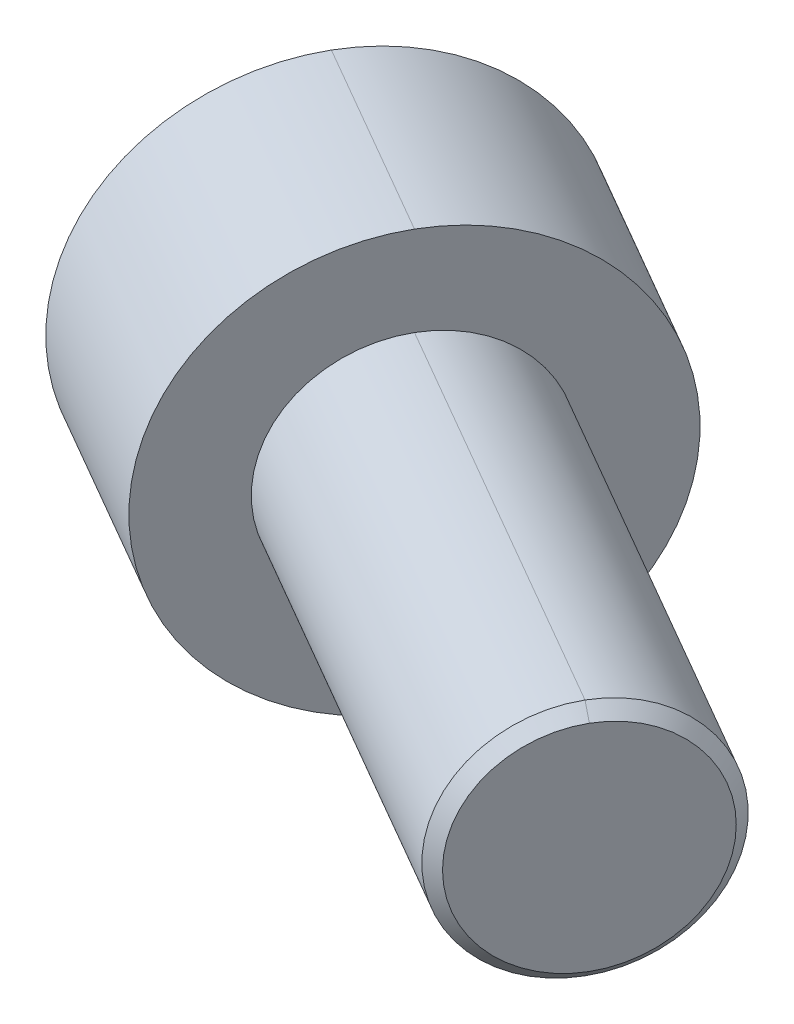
ISO-10303-21;
HEADER;
FILE_DESCRIPTION(('STEP AP214'),'2;1');
FILE_NAME('part.step','',(''),(''),'','','');
FILE_SCHEMA(('AUTOMOTIVE_DESIGN { 1 0 10303 214 1 1 1 1 }'));
ENDSEC;
DATA;
#1=APPLICATION_CONTEXT('core data for automotive mechanical design processes');
#2=APPLICATION_PROTOCOL_DEFINITION('international standard','automotive_design',2000,#1);
#3=PRODUCT_CONTEXT('',#1,'mechanical');
#4=PRODUCT('Part','Part','',(#3));
#5=PRODUCT_RELATED_PRODUCT_CATEGORY('part','',(#4));
#6=PRODUCT_DEFINITION_FORMATION('','',#4);
#7=PRODUCT_DEFINITION_CONTEXT('part definition',#1,'design');
#8=PRODUCT_DEFINITION('design','',#6,#7);
#9=PRODUCT_DEFINITION_SHAPE('','',#8);
#10=(LENGTH_UNIT() NAMED_UNIT(*) SI_UNIT(.MILLI.,.METRE.));
#11=(NAMED_UNIT(*) PLANE_ANGLE_UNIT() SI_UNIT($,.RADIAN.));
#12=(NAMED_UNIT(*) SI_UNIT($,.STERADIAN.) SOLID_ANGLE_UNIT());
#13=UNCERTAINTY_MEASURE_WITH_UNIT(LENGTH_MEASURE(1.E-05),#10,'distance_accuracy_value','');
#14=(GEOMETRIC_REPRESENTATION_CONTEXT(3) GLOBAL_UNCERTAINTY_ASSIGNED_CONTEXT((#13)) GLOBAL_UNIT_ASSIGNED_CONTEXT((#10,
#11,#12)) REPRESENTATION_CONTEXT('',''));
#15=CARTESIAN_POINT('',(0.,0.,0.));
#16=DIRECTION('',(0.,0.,1.));
#17=DIRECTION('',(1.,0.,0.));
#18=AXIS2_PLACEMENT_3D('',#15,#16,#17);
#19=CARTESIAN_POINT('',(-45.72614131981,-60.262,-26.4));
#20=DIRECTION('',(-0.866025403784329,0.,-0.50000000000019));
#21=DIRECTION('',(-0.50000000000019,0.,0.866025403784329));
#22=AXIS2_PLACEMENT_3D('',#19,#20,#21);
#23=PLANE('',#22);
#24=DIRECTION('',(-0.250000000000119,0.866025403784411,0.433012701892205));
#25=VECTOR('',#24,1.);
#26=CARTESIAN_POINT('',(-45.29312861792,-58.762,-27.15));
#27=LINE('',#26,#25);
#28=CARTESIAN_POINT('',(-44.86011591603,-60.262,-27.9));
#29=VERTEX_POINT('',#28);
#30=CARTESIAN_POINT('',(-45.29312861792,-58.762,-27.15));
#31=VERTEX_POINT('',#30);
#32=EDGE_CURVE('E142',#29,#31,#27,.T.);
#33=ORIENTED_EDGE('',*,*,#32,.F.);
#34=DIRECTION('',(0.250000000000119,0.866025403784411,-0.433012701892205));
#35=VECTOR('',#34,1.);
#36=CARTESIAN_POINT('',(-44.86011591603,-60.262,-27.9));
#37=LINE('',#36,#35);
#38=CARTESIAN_POINT('',(-45.29312861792,-61.762,-27.15));
#39=VERTEX_POINT('',#38);
#40=EDGE_CURVE('E10',#39,#29,#37,.T.);
#41=ORIENTED_EDGE('',*,*,#40,.F.);
#42=DIRECTION('',(0.50000000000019,0.,-0.866025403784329));
#43=VECTOR('',#42,1.);
#44=CARTESIAN_POINT('',(-45.29312861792,-61.762,-27.15));
#45=LINE('',#44,#43);
#46=CARTESIAN_POINT('',(-46.15915402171,-61.762,-25.65));
#47=VERTEX_POINT('',#46);
#48=EDGE_CURVE('E201',#47,#39,#45,.T.);
#49=ORIENTED_EDGE('',*,*,#48,.F.);
#50=DIRECTION('',(0.250000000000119,-0.866025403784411,-0.433012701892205));
#51=VECTOR('',#50,1.);
#52=CARTESIAN_POINT('',(-46.15915402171,-61.762,-25.65));
#53=LINE('',#52,#51);
#54=CARTESIAN_POINT('',(-46.5921667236,-60.262,-24.9));
#55=VERTEX_POINT('',#54);
#56=EDGE_CURVE('E298',#55,#47,#53,.T.);
#57=ORIENTED_EDGE('',*,*,#56,.F.);
#58=DIRECTION('',(-0.250000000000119,-0.866025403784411,0.433012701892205));
#59=VECTOR('',#58,1.);
#60=CARTESIAN_POINT('',(-46.5921667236,-60.262,-24.9));
#61=LINE('',#60,#59);
#62=CARTESIAN_POINT('',(-46.15915402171,-58.762,-25.65));
#63=VERTEX_POINT('',#62);
#64=EDGE_CURVE('E147',#63,#55,#61,.T.);
#65=ORIENTED_EDGE('',*,*,#64,.F.);
#66=DIRECTION('',(-0.50000000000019,0.,0.866025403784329));
#67=VECTOR('',#66,1.);
#68=CARTESIAN_POINT('',(-46.15915402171,-58.762,-25.65));
#69=LINE('',#68,#67);
#70=EDGE_CURVE('E206',#31,#63,#69,.T.);
#71=ORIENTED_EDGE('',*,*,#70,.F.);
#72=EDGE_LOOP('',(#33,#41,#49,#57,#65,#71));
#73=FACE_BOUND('',#72,.T.);
#74=ADVANCED_FACE('F16',(#73),#23,.T.);
#75=CARTESIAN_POINT('',(-44.86011591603,-60.262,-27.9));
#76=DIRECTION('',(-0.433012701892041,0.500000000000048,0.750000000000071));
#77=DIRECTION('',(0.755928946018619,0.654653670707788,0.));
#78=AXIS2_PLACEMENT_3D('',#75,#76,#77);
#79=PLANE('',#78);
#80=DIRECTION('',(0.250000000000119,0.866025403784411,-0.433012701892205));
#81=VECTOR('',#80,1.);
#82=CARTESIAN_POINT('',(-46.5921667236,-60.262,-28.9));
#83=LINE('',#82,#81);
#84=CARTESIAN_POINT('',(-47.02517942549,-61.762,-28.15));
#85=VERTEX_POINT('',#84);
#86=CARTESIAN_POINT('',(-46.5921667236,-60.262,-28.9));
#87=VERTEX_POINT('',#86);
#88=EDGE_CURVE('E184',#85,#87,#83,.T.);
#89=ORIENTED_EDGE('',*,*,#88,.F.);
#90=DIRECTION('',(-0.866025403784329,0.,-0.50000000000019));
#91=VECTOR('',#90,1.);
#92=CARTESIAN_POINT('',(-45.29312861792,-61.762,-27.15));
#93=LINE('',#92,#91);
#94=EDGE_CURVE('E27',#39,#85,#93,.T.);
#95=ORIENTED_EDGE('',*,*,#94,.F.);
#96=ORIENTED_EDGE('',*,*,#40,.T.);
#97=DIRECTION('',(-0.866025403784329,0.,-0.50000000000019));
#98=VECTOR('',#97,1.);
#99=CARTESIAN_POINT('',(-44.86011591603,-60.262,-27.9));
#100=LINE('',#99,#98);
#101=EDGE_CURVE('E146',#29,#87,#100,.T.);
#102=ORIENTED_EDGE('',*,*,#101,.T.);
#103=EDGE_LOOP('',(#89,#95,#96,#102));
#104=FACE_BOUND('',#103,.T.);
#105=ADVANCED_FACE('F261',(#104),#79,.T.);
#106=CARTESIAN_POINT('',(-45.29312861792,-61.762,-27.15));
#107=DIRECTION('',(0.,1.,0.));
#108=DIRECTION('',(0.,0.,-1.));
#109=AXIS2_PLACEMENT_3D('',#106,#107,#108);
#110=PLANE('',#109);
#111=DIRECTION('',(0.50000000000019,0.,-0.866025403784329));
#112=VECTOR('',#111,1.);
#113=CARTESIAN_POINT('',(-47.02517942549,-61.762,-28.15));
#114=LINE('',#113,#112);
#115=CARTESIAN_POINT('',(-47.89120482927,-61.762,-26.65));
#116=VERTEX_POINT('',#115);
#117=EDGE_CURVE('E156',#116,#85,#114,.T.);
#118=ORIENTED_EDGE('',*,*,#117,.F.);
#119=DIRECTION('',(-0.866025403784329,0.,-0.50000000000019));
#120=VECTOR('',#119,1.);
#121=CARTESIAN_POINT('',(-46.15915402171,-61.762,-25.65));
#122=LINE('',#121,#120);
#123=EDGE_CURVE('E224',#47,#116,#122,.T.);
#124=ORIENTED_EDGE('',*,*,#123,.F.);
#125=ORIENTED_EDGE('',*,*,#48,.T.);
#126=ORIENTED_EDGE('',*,*,#94,.T.);
#127=EDGE_LOOP('',(#118,#124,#125,#126));
#128=FACE_BOUND('',#127,.T.);
#129=ADVANCED_FACE('F266',(#128),#110,.T.);
#130=CARTESIAN_POINT('',(-46.15915402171,-61.762,-25.65));
#131=DIRECTION('',(0.433012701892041,0.500000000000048,-0.750000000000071));
#132=DIRECTION('',(-0.866025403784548,0.,-0.49999999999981));
#133=AXIS2_PLACEMENT_3D('',#130,#131,#132);
#134=PLANE('',#133);
#135=DIRECTION('',(0.250000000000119,-0.866025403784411,-0.433012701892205));
#136=VECTOR('',#135,1.);
#137=CARTESIAN_POINT('',(-47.89120482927,-61.762,-26.65));
#138=LINE('',#137,#136);
#139=CARTESIAN_POINT('',(-48.32421753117,-60.262,-25.9));
#140=VERTEX_POINT('',#139);
#141=EDGE_CURVE('E159',#140,#116,#138,.T.);
#142=ORIENTED_EDGE('',*,*,#141,.F.);
#143=DIRECTION('',(-0.866025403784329,0.,-0.50000000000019));
#144=VECTOR('',#143,1.);
#145=CARTESIAN_POINT('',(-46.5921667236,-60.262,-24.9));
#146=LINE('',#145,#144);
#147=EDGE_CURVE('E151',#55,#140,#146,.T.);
#148=ORIENTED_EDGE('',*,*,#147,.F.);
#149=ORIENTED_EDGE('',*,*,#56,.T.);
#150=ORIENTED_EDGE('',*,*,#123,.T.);
#151=EDGE_LOOP('',(#142,#148,#149,#150));
#152=FACE_BOUND('',#151,.T.);
#153=ADVANCED_FACE('F18',(#152),#134,.T.);
#154=CARTESIAN_POINT('',(-46.5921667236,-60.262,-24.9));
#155=DIRECTION('',(0.433012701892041,-0.500000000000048,-0.750000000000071));
#156=DIRECTION('',(0.,-0.832050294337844,0.554700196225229));
#157=AXIS2_PLACEMENT_3D('',#154,#155,#156);
#158=PLANE('',#157);
#159=DIRECTION('',(-0.250000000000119,-0.866025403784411,0.433012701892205));
#160=VECTOR('',#159,1.);
#161=CARTESIAN_POINT('',(-48.32421753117,-60.262,-25.9));
#162=LINE('',#161,#160);
#163=CARTESIAN_POINT('',(-47.89120482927,-58.762,-26.65));
#164=VERTEX_POINT('',#163);
#165=EDGE_CURVE('E173',#164,#140,#162,.T.);
#166=ORIENTED_EDGE('',*,*,#165,.F.);
#167=DIRECTION('',(-0.866025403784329,0.,-0.50000000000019));
#168=VECTOR('',#167,1.);
#169=CARTESIAN_POINT('',(-46.15915402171,-58.762,-25.65));
#170=LINE('',#169,#168);
#171=EDGE_CURVE('E20',#63,#164,#170,.T.);
#172=ORIENTED_EDGE('',*,*,#171,.F.);
#173=ORIENTED_EDGE('',*,*,#64,.T.);
#174=ORIENTED_EDGE('',*,*,#147,.T.);
#175=EDGE_LOOP('',(#166,#172,#173,#174));
#176=FACE_BOUND('',#175,.T.);
#177=ADVANCED_FACE('F346',(#176),#158,.T.);
#178=CARTESIAN_POINT('',(-46.15915402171,-58.762,-25.65));
#179=DIRECTION('',(0.,-1.,0.));
#180=DIRECTION('',(0.,0.,-1.));
#181=AXIS2_PLACEMENT_3D('',#178,#179,#180);
#182=PLANE('',#181);
#183=DIRECTION('',(-0.50000000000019,0.,0.866025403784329));
#184=VECTOR('',#183,1.);
#185=CARTESIAN_POINT('',(-47.89120482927,-58.762,-26.65));
#186=LINE('',#185,#184);
#187=CARTESIAN_POINT('',(-47.02517942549,-58.762,-28.15));
#188=VERTEX_POINT('',#187);
#189=EDGE_CURVE('E170',#188,#164,#186,.T.);
#190=ORIENTED_EDGE('',*,*,#189,.F.);
#191=DIRECTION('',(-0.866025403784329,0.,-0.50000000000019));
#192=VECTOR('',#191,1.);
#193=CARTESIAN_POINT('',(-45.29312861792,-58.762,-27.15));
#194=LINE('',#193,#192);
#195=EDGE_CURVE('E145',#31,#188,#194,.T.);
#196=ORIENTED_EDGE('',*,*,#195,.F.);
#197=ORIENTED_EDGE('',*,*,#70,.T.);
#198=ORIENTED_EDGE('',*,*,#171,.T.);
#199=EDGE_LOOP('',(#190,#196,#197,#198));
#200=FACE_BOUND('',#199,.T.);
#201=ADVANCED_FACE('F255',(#200),#182,.T.);
#202=CARTESIAN_POINT('',(-45.29312861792,-58.762,-27.15));
#203=DIRECTION('',(-0.433012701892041,-0.500000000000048,0.750000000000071));
#204=DIRECTION('',(-0.755928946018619,0.654653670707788,0.));
#205=AXIS2_PLACEMENT_3D('',#202,#203,#204);
#206=PLANE('',#205);
#207=DIRECTION('',(-0.250000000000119,0.866025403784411,0.433012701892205));
#208=VECTOR('',#207,1.);
#209=CARTESIAN_POINT('',(-47.02517942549,-58.762,-28.15));
#210=LINE('',#209,#208);
#211=EDGE_CURVE('E174',#87,#188,#210,.T.);
#212=ORIENTED_EDGE('',*,*,#211,.F.);
#213=ORIENTED_EDGE('',*,*,#101,.F.);
#214=ORIENTED_EDGE('',*,*,#32,.T.);
#215=ORIENTED_EDGE('',*,*,#195,.T.);
#216=EDGE_LOOP('',(#212,#213,#214,#215));
#217=FACE_BOUND('',#216,.T.);
#218=ADVANCED_FACE('F246',(#217),#206,.T.);
#219=CARTESIAN_POINT('',(-36.16588728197,-60.262,-22.95884572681));
#220=DIRECTION('',(0.866025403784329,0.,0.50000000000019));
#221=DIRECTION('',(0.,-1.,0.));
#222=AXIS2_PLACEMENT_3D('',#219,#220,#221);
#223=PLANE('',#222);
#224=CARTESIAN_POINT('',(-37.06588728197,-60.262,-21.4));
#225=DIRECTION('',(-0.866025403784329,0.,-0.50000000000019));
#226=DIRECTION('',(0.,1.,0.));
#227=AXIS2_PLACEMENT_3D('',#224,#225,#226);
#228=CIRCLE('',#227,1.8);
#229=CARTESIAN_POINT('',(-37.06588728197,-58.462,-21.4));
#230=VERTEX_POINT('',#229);
#231=CARTESIAN_POINT('',(-37.06588728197,-62.062,-21.4));
#232=VERTEX_POINT('',#231);
#233=EDGE_CURVE('E161',#230,#232,#228,.T.);
#234=ORIENTED_EDGE('',*,*,#233,.F.);
#235=CARTESIAN_POINT('',(-37.06588728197,-60.262,-21.4));
#236=DIRECTION('',(-0.866025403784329,0.,-0.50000000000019));
#237=DIRECTION('',(0.,1.,0.));
#238=AXIS2_PLACEMENT_3D('',#235,#236,#237);
#239=CIRCLE('',#238,1.8);
#240=EDGE_CURVE('E155',#232,#230,#239,.T.);
#241=ORIENTED_EDGE('',*,*,#240,.F.);
#242=EDGE_LOOP('',(#234,#241));
#243=FACE_BOUND('',#242,.T.);
#244=ADVANCED_FACE('F244',(#243),#223,.T.);
#245=CARTESIAN_POINT('',(-37.23909236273,-60.262,-21.5));
#246=DIRECTION('',(-0.866025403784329,0.,-0.50000000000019));
#247=DIRECTION('',(0.,1.,0.));
#248=AXIS2_PLACEMENT_3D('',#245,#246,#247);
#249=CONICAL_SURFACE('',#248,2.,0.785398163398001);
#250=DIRECTION('',(-0.612372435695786,-0.707106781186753,-0.353553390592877));
#251=VECTOR('',#250,1.);
#252=CARTESIAN_POINT('',(-37.23909236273,-62.262,-21.5));
#253=LINE('',#252,#251);
#254=CARTESIAN_POINT('',(-37.23909236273,-62.262,-21.5));
#255=VERTEX_POINT('',#254);
#256=EDGE_CURVE('E165',#232,#255,#253,.T.);
#257=ORIENTED_EDGE('',*,*,#256,.F.);
#258=ORIENTED_EDGE('',*,*,#240,.T.);
#259=DIRECTION('',(-0.612372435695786,0.707106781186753,-0.353553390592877));
#260=VECTOR('',#259,1.);
#261=CARTESIAN_POINT('',(-37.23909236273,-58.262,-21.5));
#262=LINE('',#261,#260);
#263=CARTESIAN_POINT('',(-37.23909236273,-58.262,-21.5));
#264=VERTEX_POINT('',#263);
#265=EDGE_CURVE('E140',#230,#264,#262,.T.);
#266=ORIENTED_EDGE('',*,*,#265,.T.);
#267=CARTESIAN_POINT('',(-37.23909236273,-60.262,-21.5));
#268=DIRECTION('',(-0.866025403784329,0.,-0.50000000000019));
#269=DIRECTION('',(0.,1.,0.));
#270=AXIS2_PLACEMENT_3D('',#267,#268,#269);
#271=CIRCLE('',#270,2.);
#272=EDGE_CURVE('E210',#255,#264,#271,.T.);
#273=ORIENTED_EDGE('',*,*,#272,.F.);
#274=EDGE_LOOP('',(#257,#258,#266,#273));
#275=FACE_BOUND('',#274,.T.);
#276=ADVANCED_FACE('F237',(#275),#249,.T.);
#277=CARTESIAN_POINT('',(-477.0067924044,-60.262,-275.4));
#278=DIRECTION('',(-0.866025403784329,0.,-0.50000000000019));
#279=DIRECTION('',(0.,1.,0.));
#280=AXIS2_PLACEMENT_3D('',#277,#278,#279);
#281=CYLINDRICAL_SURFACE('',#280,2.);
#282=DIRECTION('',(-0.866025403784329,0.,-0.50000000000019));
#283=VECTOR('',#282,1.);
#284=CARTESIAN_POINT('',(-477.0067924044,-62.262,-275.4));
#285=LINE('',#284,#283);
#286=CARTESIAN_POINT('',(-43.99409051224,-62.262,-25.4));
#287=VERTEX_POINT('',#286);
#288=EDGE_CURVE('E225',#255,#287,#285,.T.);
#289=ORIENTED_EDGE('',*,*,#288,.F.);
#290=ORIENTED_EDGE('',*,*,#272,.T.);
#291=DIRECTION('',(-0.866025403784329,0.,-0.50000000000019));
#292=VECTOR('',#291,1.);
#293=CARTESIAN_POINT('',(-477.0067924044,-58.262,-275.4));
#294=LINE('',#293,#292);
#295=CARTESIAN_POINT('',(-43.99409051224,-58.262,-25.4));
#296=VERTEX_POINT('',#295);
#297=EDGE_CURVE('E127',#264,#296,#294,.T.);
#298=ORIENTED_EDGE('',*,*,#297,.T.);
#299=CARTESIAN_POINT('',(-43.99409051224,-60.262,-25.4));
#300=DIRECTION('',(-0.866025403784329,0.,-0.50000000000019));
#301=DIRECTION('',(0.,1.,0.));
#302=AXIS2_PLACEMENT_3D('',#299,#300,#301);
#303=CIRCLE('',#302,2.);
#304=EDGE_CURVE('E113',#287,#296,#303,.T.);
#305=ORIENTED_EDGE('',*,*,#304,.F.);
#306=EDGE_LOOP('',(#289,#290,#298,#305));
#307=FACE_BOUND('',#306,.T.);
#308=ADVANCED_FACE('F253',(#307),#281,.T.);
#309=CARTESIAN_POINT('',(-42.24409051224,-60.262,-28.43108891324));
#310=DIRECTION('',(0.866025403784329,0.,0.50000000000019));
#311=DIRECTION('',(0.,-1.,0.));
#312=AXIS2_PLACEMENT_3D('',#309,#310,#311);
#313=PLANE('',#312);
#314=CARTESIAN_POINT('',(-43.99409051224,-60.262,-25.4));
#315=DIRECTION('',(-0.866025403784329,0.,-0.50000000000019));
#316=DIRECTION('',(0.,1.,0.));
#317=AXIS2_PLACEMENT_3D('',#314,#315,#316);
#318=CIRCLE('',#317,3.5);
#319=CARTESIAN_POINT('',(-43.99409051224,-56.762,-25.4));
#320=VERTEX_POINT('',#319);
#321=CARTESIAN_POINT('',(-43.99409051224,-63.762,-25.4));
#322=VERTEX_POINT('',#321);
#323=EDGE_CURVE('E118',#320,#322,#318,.T.);
#324=ORIENTED_EDGE('',*,*,#323,.F.);
#325=CARTESIAN_POINT('',(-43.99409051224,-60.262,-25.4));
#326=DIRECTION('',(-0.866025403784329,0.,-0.50000000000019));
#327=DIRECTION('',(0.,1.,0.));
#328=AXIS2_PLACEMENT_3D('',#325,#326,#327);
#329=CIRCLE('',#328,3.5);
#330=EDGE_CURVE('E101',#322,#320,#329,.T.);
#331=ORIENTED_EDGE('',*,*,#330,.F.);
#332=EDGE_LOOP('',(#324,#331));
#333=FACE_BOUND('',#332,.T.);
#334=CARTESIAN_POINT('',(-43.99409051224,-60.262,-25.4));
#335=DIRECTION('',(-0.866025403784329,0.,-0.50000000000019));
#336=DIRECTION('',(0.,1.,0.));
#337=AXIS2_PLACEMENT_3D('',#334,#335,#336);
#338=CIRCLE('',#337,2.);
#339=EDGE_CURVE('E136',#296,#287,#338,.T.);
#340=ORIENTED_EDGE('',*,*,#339,.T.);
#341=ORIENTED_EDGE('',*,*,#304,.T.);
#342=EDGE_LOOP('',(#340,#341));
#343=FACE_BOUND('',#342,.T.);
#344=ADVANCED_FACE('F124',(#333,#343),#313,.T.);
#345=CARTESIAN_POINT('',(-477.0067924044,-60.262,-275.4));
#346=DIRECTION('',(-0.866025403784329,0.,-0.50000000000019));
#347=DIRECTION('',(0.,1.,0.));
#348=AXIS2_PLACEMENT_3D('',#345,#346,#347);
#349=CYLINDRICAL_SURFACE('',#348,3.5);
#350=DIRECTION('',(-0.866025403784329,0.,-0.50000000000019));
#351=VECTOR('',#350,1.);
#352=CARTESIAN_POINT('',(-477.0067924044,-63.762,-275.4));
#353=LINE('',#352,#351);
#354=CARTESIAN_POINT('',(-47.28498704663,-63.762,-27.3));
#355=VERTEX_POINT('',#354);
#356=EDGE_CURVE('E108',#322,#355,#353,.T.);
#357=ORIENTED_EDGE('',*,*,#356,.F.);
#358=ORIENTED_EDGE('',*,*,#330,.T.);
#359=DIRECTION('',(-0.866025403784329,0.,-0.50000000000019));
#360=VECTOR('',#359,1.);
#361=CARTESIAN_POINT('',(-477.0067924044,-56.762,-275.4));
#362=LINE('',#361,#360);
#363=CARTESIAN_POINT('',(-47.28498704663,-56.762,-27.3));
#364=VERTEX_POINT('',#363);
#365=EDGE_CURVE('E105',#320,#364,#362,.T.);
#366=ORIENTED_EDGE('',*,*,#365,.T.);
#367=CARTESIAN_POINT('',(-47.28498704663,-60.262,-27.3));
#368=DIRECTION('',(-0.866025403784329,0.,-0.50000000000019));
#369=DIRECTION('',(0.,1.,0.));
#370=AXIS2_PLACEMENT_3D('',#367,#368,#369);
#371=CIRCLE('',#370,3.5);
#372=EDGE_CURVE('E114',#355,#364,#371,.T.);
#373=ORIENTED_EDGE('',*,*,#372,.F.);
#374=EDGE_LOOP('',(#357,#358,#366,#373));
#375=FACE_BOUND('',#374,.T.);
#376=ADVANCED_FACE('F103',(#375),#349,.T.);
#377=CARTESIAN_POINT('',(-47.45819212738,-60.262,-27.4));
#378=DIRECTION('',(0.866025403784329,0.,0.50000000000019));
#379=DIRECTION('',(0.,-1.,0.));
#380=AXIS2_PLACEMENT_3D('',#377,#378,#379);
#381=CONICAL_SURFACE('',#380,3.3,0.785398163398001);
#382=DIRECTION('',(0.612372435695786,0.707106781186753,0.353553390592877));
#383=VECTOR('',#382,1.);
#384=CARTESIAN_POINT('',(-47.45819212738,-56.962,-27.4));
#385=LINE('',#384,#383);
#386=CARTESIAN_POINT('',(-47.45819212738,-56.962,-27.4));
#387=VERTEX_POINT('',#386);
#388=EDGE_CURVE('E166',#387,#364,#385,.T.);
#389=ORIENTED_EDGE('',*,*,#388,.F.);
#390=CARTESIAN_POINT('',(-47.45819212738,-60.262,-27.4));
#391=DIRECTION('',(-0.866025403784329,0.,-0.50000000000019));
#392=DIRECTION('',(0.,1.,0.));
#393=AXIS2_PLACEMENT_3D('',#390,#391,#392);
#394=CIRCLE('',#393,3.3);
#395=CARTESIAN_POINT('',(-47.45819212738,-63.562,-27.4));
#396=VERTEX_POINT('',#395);
#397=EDGE_CURVE('E192',#396,#387,#394,.T.);
#398=ORIENTED_EDGE('',*,*,#397,.F.);
#399=DIRECTION('',(0.612372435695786,-0.707106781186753,0.353553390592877));
#400=VECTOR('',#399,1.);
#401=CARTESIAN_POINT('',(-47.45819212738,-63.562,-27.4));
#402=LINE('',#401,#400);
#403=EDGE_CURVE('E169',#396,#355,#402,.T.);
#404=ORIENTED_EDGE('',*,*,#403,.T.);
#405=ORIENTED_EDGE('',*,*,#372,.T.);
#406=EDGE_LOOP('',(#389,#398,#404,#405));
#407=FACE_BOUND('',#406,.T.);
#408=ADVANCED_FACE('F272',(#407),#381,.T.);
#409=CARTESIAN_POINT('',(-47.45819212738,-60.262,-27.4));
#410=DIRECTION('',(-0.866025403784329,0.,-0.50000000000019));
#411=DIRECTION('',(-0.50000000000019,0.,0.866025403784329));
#412=AXIS2_PLACEMENT_3D('',#409,#410,#411);
#413=PLANE('',#412);
#414=ORIENTED_EDGE('',*,*,#88,.T.);
#415=ORIENTED_EDGE('',*,*,#211,.T.);
#416=ORIENTED_EDGE('',*,*,#189,.T.);
#417=ORIENTED_EDGE('',*,*,#165,.T.);
#418=ORIENTED_EDGE('',*,*,#141,.T.);
#419=ORIENTED_EDGE('',*,*,#117,.T.);
#420=EDGE_LOOP('',(#414,#415,#416,#417,#418,#419));
#421=FACE_BOUND('',#420,.T.);
#422=ORIENTED_EDGE('',*,*,#397,.T.);
#423=CARTESIAN_POINT('',(-47.45819212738,-60.262,-27.4));
#424=DIRECTION('',(-0.866025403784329,0.,-0.50000000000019));
#425=DIRECTION('',(0.,1.,0.));
#426=AXIS2_PLACEMENT_3D('',#423,#424,#425);
#427=CIRCLE('',#426,3.3);
#428=EDGE_CURVE('E122',#387,#396,#427,.T.);
#429=ORIENTED_EDGE('',*,*,#428,.T.);
#430=EDGE_LOOP('',(#422,#429));
#431=FACE_BOUND('',#430,.T.);
#432=ADVANCED_FACE('F269',(#421,#431),#413,.T.);
#433=CARTESIAN_POINT('',(-47.45819212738,-60.262,-27.4));
#434=DIRECTION('',(0.866025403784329,0.,0.50000000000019));
#435=DIRECTION('',(0.,-1.,0.));
#436=AXIS2_PLACEMENT_3D('',#433,#434,#435);
#437=CONICAL_SURFACE('',#436,3.3,0.785398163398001);
#438=ORIENTED_EDGE('',*,*,#428,.F.);
#439=ORIENTED_EDGE('',*,*,#388,.T.);
#440=CARTESIAN_POINT('',(-47.28498704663,-60.262,-27.3));
#441=DIRECTION('',(-0.866025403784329,0.,-0.50000000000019));
#442=DIRECTION('',(0.,1.,0.));
#443=AXIS2_PLACEMENT_3D('',#440,#441,#442);
#444=CIRCLE('',#443,3.5);
#445=EDGE_CURVE('E120',#364,#355,#444,.T.);
#446=ORIENTED_EDGE('',*,*,#445,.T.);
#447=ORIENTED_EDGE('',*,*,#403,.F.);
#448=EDGE_LOOP('',(#438,#439,#446,#447));
#449=FACE_BOUND('',#448,.T.);
#450=ADVANCED_FACE('F271',(#449),#437,.T.);
#451=CARTESIAN_POINT('',(-477.0067924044,-60.262,-275.4));
#452=DIRECTION('',(-0.866025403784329,0.,-0.50000000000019));
#453=DIRECTION('',(0.,1.,0.));
#454=AXIS2_PLACEMENT_3D('',#451,#452,#453);
#455=CYLINDRICAL_SURFACE('',#454,3.5);
#456=ORIENTED_EDGE('',*,*,#323,.T.);
#457=ORIENTED_EDGE('',*,*,#356,.T.);
#458=ORIENTED_EDGE('',*,*,#445,.F.);
#459=ORIENTED_EDGE('',*,*,#365,.F.);
#460=EDGE_LOOP('',(#456,#457,#458,#459));
#461=FACE_BOUND('',#460,.T.);
#462=ADVANCED_FACE('F117',(#461),#455,.T.);
#463=CARTESIAN_POINT('',(-477.0067924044,-60.262,-275.4));
#464=DIRECTION('',(-0.866025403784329,0.,-0.50000000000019));
#465=DIRECTION('',(0.,1.,0.));
#466=AXIS2_PLACEMENT_3D('',#463,#464,#465);
#467=CYLINDRICAL_SURFACE('',#466,2.);
#468=CARTESIAN_POINT('',(-37.23909236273,-60.262,-21.5));
#469=DIRECTION('',(-0.866025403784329,0.,-0.50000000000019));
#470=DIRECTION('',(0.,1.,0.));
#471=AXIS2_PLACEMENT_3D('',#468,#469,#470);
#472=CIRCLE('',#471,2.);
#473=EDGE_CURVE('E199',#264,#255,#472,.T.);
#474=ORIENTED_EDGE('',*,*,#473,.T.);
#475=ORIENTED_EDGE('',*,*,#288,.T.);
#476=ORIENTED_EDGE('',*,*,#339,.F.);
#477=ORIENTED_EDGE('',*,*,#297,.F.);
#478=EDGE_LOOP('',(#474,#475,#476,#477));
#479=FACE_BOUND('',#478,.T.);
#480=ADVANCED_FACE('F321',(#479),#467,.T.);
#481=CARTESIAN_POINT('',(-37.23909236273,-60.262,-21.5));
#482=DIRECTION('',(-0.866025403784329,0.,-0.50000000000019));
#483=DIRECTION('',(0.,1.,0.));
#484=AXIS2_PLACEMENT_3D('',#481,#482,#483);
#485=CONICAL_SURFACE('',#484,2.,0.785398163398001);
#486=ORIENTED_EDGE('',*,*,#233,.T.);
#487=ORIENTED_EDGE('',*,*,#256,.T.);
#488=ORIENTED_EDGE('',*,*,#473,.F.);
#489=ORIENTED_EDGE('',*,*,#265,.F.);
#490=EDGE_LOOP('',(#486,#487,#488,#489));
#491=FACE_BOUND('',#490,.T.);
#492=ADVANCED_FACE('F243',(#491),#485,.T.);
#493=CLOSED_SHELL('',(#74,#105,#129,#153,#177,#201,#218,#244,#276,#308,#344,#376,#408,#432,#450,
#462,#480,#492));
#494=MANIFOLD_SOLID_BREP('B1',#493);
#495=ADVANCED_BREP_SHAPE_REPRESENTATION('',(#18,#494),#14);
#496=SHAPE_DEFINITION_REPRESENTATION(#9,#495);
ENDSEC;
END-ISO-10303-21;
